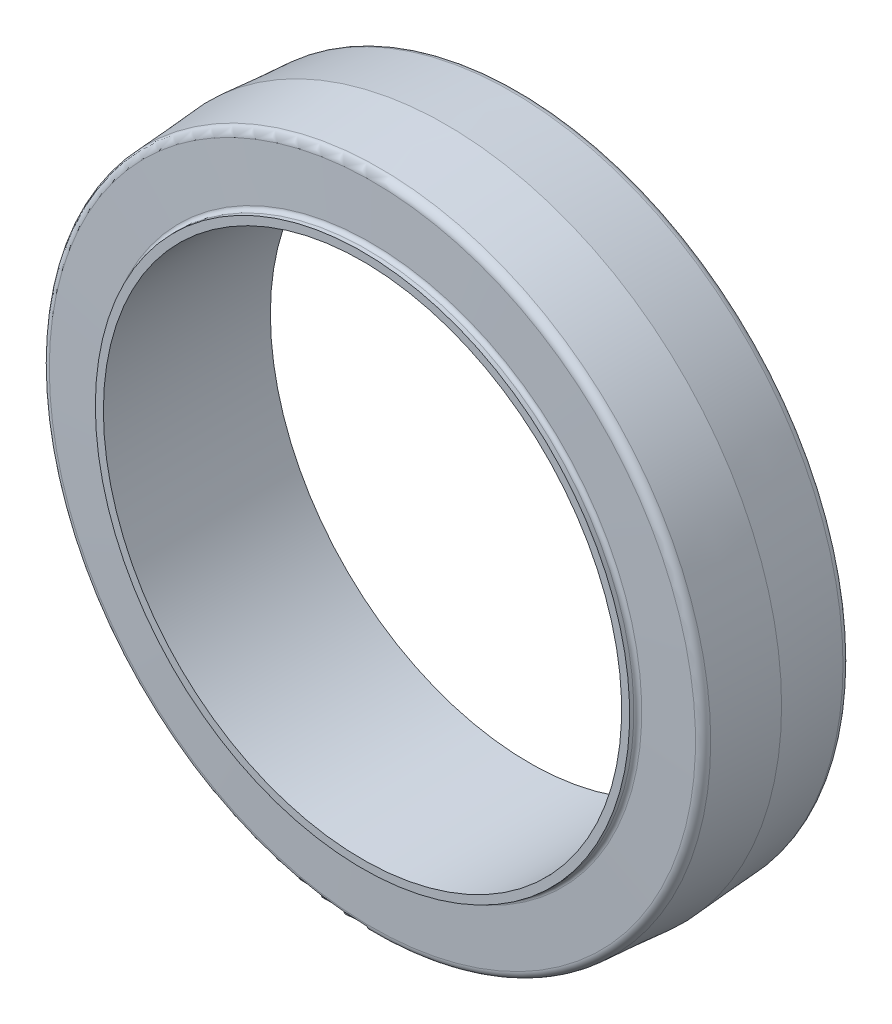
ISO-10303-21;
HEADER;
FILE_DESCRIPTION(('STEP AP214'),'2;1');
FILE_NAME('part.step','',(''),(''),'','','');
FILE_SCHEMA(('AUTOMOTIVE_DESIGN { 1 0 10303 214 1 1 1 1 }'));
ENDSEC;
DATA;
#1=APPLICATION_CONTEXT('core data for automotive mechanical design processes');
#2=APPLICATION_PROTOCOL_DEFINITION('international standard','automotive_design',2000,#1);
#3=PRODUCT_CONTEXT('',#1,'mechanical');
#4=PRODUCT('Part','Part','',(#3));
#5=PRODUCT_RELATED_PRODUCT_CATEGORY('part','',(#4));
#6=PRODUCT_DEFINITION_FORMATION('','',#4);
#7=PRODUCT_DEFINITION_CONTEXT('part definition',#1,'design');
#8=PRODUCT_DEFINITION('design','',#6,#7);
#9=PRODUCT_DEFINITION_SHAPE('','',#8);
#10=(LENGTH_UNIT() NAMED_UNIT(*) SI_UNIT(.MILLI.,.METRE.));
#11=(NAMED_UNIT(*) PLANE_ANGLE_UNIT() SI_UNIT($,.RADIAN.));
#12=(NAMED_UNIT(*) SI_UNIT($,.STERADIAN.) SOLID_ANGLE_UNIT());
#13=UNCERTAINTY_MEASURE_WITH_UNIT(LENGTH_MEASURE(1.E-05),#10,'distance_accuracy_value','');
#14=(GEOMETRIC_REPRESENTATION_CONTEXT(3) GLOBAL_UNCERTAINTY_ASSIGNED_CONTEXT((#13)) GLOBAL_UNIT_ASSIGNED_CONTEXT((#10,
#11,#12)) REPRESENTATION_CONTEXT('',''));
#15=CARTESIAN_POINT('',(0.,0.,0.));
#16=DIRECTION('',(0.,0.,1.));
#17=DIRECTION('',(1.,0.,0.));
#18=AXIS2_PLACEMENT_3D('',#15,#16,#17);
#19=CARTESIAN_POINT('',(0.,0.,0.));
#20=DIRECTION('',(0.,0.,-1.));
#21=DIRECTION('',(-1.,0.,0.));
#22=AXIS2_PLACEMENT_3D('',#19,#20,#21);
#23=CONICAL_SURFACE('',#22,63.5508,0.0712094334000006);
#24=CARTESIAN_POINT('',(0.,0.,7.27196081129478E-11));
#25=DIRECTION('',(0.,0.,1.));
#26=DIRECTION('',(1.,0.,0.));
#27=AXIS2_PLACEMENT_3D('',#24,#25,#26);
#28=CIRCLE('',#27,63.5507999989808);
#29=CARTESIAN_POINT('',(63.5507999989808,0.,7.27490984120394E-11));
#30=VERTEX_POINT('',#29);
#31=EDGE_CURVE('E124',#30,#30,#28,.F.);
#32=ORIENTED_EDGE('',*,*,#31,.F.);
#33=EDGE_LOOP('',(#32));
#34=FACE_BOUND('',#33,.T.);
#35=CARTESIAN_POINT('',(0.,0.,12.5251314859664));
#36=DIRECTION('',(0.,0.,-1.));
#37=DIRECTION('',(-1.,0.,0.));
#38=AXIS2_PLACEMENT_3D('',#35,#36,#37);
#39=CIRCLE('',#38,62.6573818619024);
#40=CARTESIAN_POINT('',(-62.6573818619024,0.,12.5251314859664));
#41=VERTEX_POINT('',#40);
#42=EDGE_CURVE('E121',#41,#41,#39,.F.);
#43=ORIENTED_EDGE('',*,*,#42,.F.);
#44=EDGE_LOOP('',(#43));
#45=FACE_BOUND('',#44,.T.);
#46=ADVANCED_FACE('F17',(#34,#45),#23,.T.);
#47=CARTESIAN_POINT('',(0.,0.,7.26727705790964E-11));
#48=DIRECTION('',(0.,0.,1.));
#49=DIRECTION('',(1.,0.,0.));
#50=AXIS2_PLACEMENT_3D('',#47,#48,#49);
#51=CONICAL_SURFACE('',#50,63.5507999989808,0.0712094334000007);
#52=ORIENTED_EDGE('',*,*,#31,.T.);
#53=EDGE_LOOP('',(#52));
#54=FACE_BOUND('',#53,.T.);
#55=CARTESIAN_POINT('',(0.,0.,-12.5251314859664));
#56=DIRECTION('',(0.,0.,-1.));
#57=DIRECTION('',(-1.,0.,0.));
#58=AXIS2_PLACEMENT_3D('',#55,#56,#57);
#59=CIRCLE('',#58,62.6573818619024);
#60=CARTESIAN_POINT('',(-62.6573818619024,0.,-12.5251314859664));
#61=VERTEX_POINT('',#60);
#62=EDGE_CURVE('E101',#61,#61,#59,.T.);
#63=ORIENTED_EDGE('',*,*,#62,.F.);
#64=EDGE_LOOP('',(#63));
#65=FACE_BOUND('',#64,.T.);
#66=ADVANCED_FACE('F116',(#54,#65),#51,.T.);
#67=CARTESIAN_POINT('',(0.,0.,12.416700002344));
#68=DIRECTION('',(0.,0.,-1.));
#69=DIRECTION('',(-1.,0.,0.));
#70=AXIS2_PLACEMENT_3D('',#67,#68,#69);
#71=TOROIDAL_SURFACE('',#70,61.1372441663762,1.524);
#72=ORIENTED_EDGE('',*,*,#42,.T.);
#73=EDGE_LOOP('',(#72));
#74=FACE_BOUND('',#73,.T.);
#75=CARTESIAN_POINT('',(0.,0.,13.9398796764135));
#76=DIRECTION('',(0.,0.,-1.));
#77=DIRECTION('',(-1.,0.,0.));
#78=AXIS2_PLACEMENT_3D('',#75,#76,#77);
#79=CIRCLE('',#78,61.1872409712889);
#80=CARTESIAN_POINT('',(-61.1872409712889,0.,13.9398796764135));
#81=VERTEX_POINT('',#80);
#82=EDGE_CURVE('E95',#81,#81,#79,.F.);
#83=ORIENTED_EDGE('',*,*,#82,.F.);
#84=EDGE_LOOP('',(#83));
#85=FACE_BOUND('',#84,.T.);
#86=ADVANCED_FACE('F112',(#74,#85),#71,.T.);
#87=CARTESIAN_POINT('',(0.,0.,-12.416700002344));
#88=DIRECTION('',(0.,0.,-1.));
#89=DIRECTION('',(-1.,0.,0.));
#90=AXIS2_PLACEMENT_3D('',#87,#88,#89);
#91=TOROIDAL_SURFACE('',#90,61.1372441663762,1.524);
#92=CARTESIAN_POINT('',(0.,0.,-13.939879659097));
#93=DIRECTION('',(0.,0.,1.));
#94=DIRECTION('',(1.,0.,0.));
#95=AXIS2_PLACEMENT_3D('',#92,#93,#94);
#96=CIRCLE('',#95,61.1872409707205);
#97=CARTESIAN_POINT('',(61.1872409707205,0.,-13.939879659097));
#98=VERTEX_POINT('',#97);
#99=EDGE_CURVE('E89',#98,#98,#96,.F.);
#100=ORIENTED_EDGE('',*,*,#99,.F.);
#101=EDGE_LOOP('',(#100));
#102=FACE_BOUND('',#101,.T.);
#103=ORIENTED_EDGE('',*,*,#62,.T.);
#104=EDGE_LOOP('',(#103));
#105=FACE_BOUND('',#104,.T.);
#106=ADVANCED_FACE('F108',(#102,#105),#91,.T.);
#107=CARTESIAN_POINT('',(0.,0.,13.9398796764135));
#108=DIRECTION('',(0.,0.,-1.));
#109=DIRECTION('',(-1.,0.,0.));
#110=AXIS2_PLACEMENT_3D('',#107,#108,#109);
#111=CONICAL_SURFACE('',#110,61.1872409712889,1.53798413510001);
#112=ORIENTED_EDGE('',*,*,#82,.T.);
#113=EDGE_LOOP('',(#112));
#114=FACE_BOUND('',#113,.T.);
#115=CARTESIAN_POINT('',(0.,0.,14.263308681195));
#116=DIRECTION('',(0.,0.,-1.));
#117=DIRECTION('',(-1.,0.,0.));
#118=AXIS2_PLACEMENT_3D('',#115,#116,#117);
#119=CIRCLE('',#118,51.3338015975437);
#120=CARTESIAN_POINT('',(-51.3338015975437,0.,14.263308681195));
#121=VERTEX_POINT('',#120);
#122=EDGE_CURVE('E86',#121,#121,#119,.T.);
#123=ORIENTED_EDGE('',*,*,#122,.T.);
#124=EDGE_LOOP('',(#123));
#125=FACE_BOUND('',#124,.T.);
#126=ADVANCED_FACE('F111',(#114,#125),#111,.T.);
#127=CARTESIAN_POINT('',(0.,0.,-13.939879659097));
#128=DIRECTION('',(0.,0.,1.));
#129=DIRECTION('',(0.,-1.,0.));
#130=AXIS2_PLACEMENT_3D('',#127,#128,#129);
#131=CONICAL_SURFACE('',#130,61.1872409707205,1.53798413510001);
#132=ORIENTED_EDGE('',*,*,#99,.T.);
#133=EDGE_LOOP('',(#132));
#134=FACE_BOUND('',#133,.T.);
#135=CARTESIAN_POINT('',(0.,0.,-14.263308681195));
#136=DIRECTION('',(0.,0.,-1.));
#137=DIRECTION('',(-1.,0.,0.));
#138=AXIS2_PLACEMENT_3D('',#135,#136,#137);
#139=CIRCLE('',#138,51.3338015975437);
#140=CARTESIAN_POINT('',(-51.3338015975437,0.,-14.263308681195));
#141=VERTEX_POINT('',#140);
#142=EDGE_CURVE('E58',#141,#141,#139,.F.);
#143=ORIENTED_EDGE('',*,*,#142,.T.);
#144=EDGE_LOOP('',(#143));
#145=FACE_BOUND('',#144,.T.);
#146=ADVANCED_FACE('F80',(#134,#145),#131,.T.);
#147=CARTESIAN_POINT('',(0.,0.,15.0248985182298));
#148=DIRECTION('',(0.,0.,-1.));
#149=DIRECTION('',(-1.,0.,0.));
#150=AXIS2_PLACEMENT_3D('',#147,#148,#149);
#151=TOROIDAL_SURFACE('',#150,51.3588,0.762);
#152=CARTESIAN_POINT('',(0.,0.,15.0248985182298));
#153=DIRECTION('',(0.,0.,-1.));
#154=DIRECTION('',(-1.,0.,0.));
#155=AXIS2_PLACEMENT_3D('',#152,#153,#154);
#156=CIRCLE('',#155,50.5968);
#157=CARTESIAN_POINT('',(-50.5968,0.,15.0248985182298));
#158=VERTEX_POINT('',#157);
#159=EDGE_CURVE('E52',#158,#158,#156,.F.);
#160=ORIENTED_EDGE('',*,*,#159,.F.);
#161=EDGE_LOOP('',(#160));
#162=FACE_BOUND('',#161,.T.);
#163=ORIENTED_EDGE('',*,*,#122,.F.);
#164=EDGE_LOOP('',(#163));
#165=FACE_BOUND('',#164,.T.);
#166=ADVANCED_FACE('F74',(#162,#165),#151,.F.);
#167=CARTESIAN_POINT('',(0.,0.,-15.0248985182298));
#168=DIRECTION('',(0.,0.,-1.));
#169=DIRECTION('',(-1.,0.,0.));
#170=AXIS2_PLACEMENT_3D('',#167,#168,#169);
#171=TOROIDAL_SURFACE('',#170,51.3588,0.762);
#172=ORIENTED_EDGE('',*,*,#142,.F.);
#173=EDGE_LOOP('',(#172));
#174=FACE_BOUND('',#173,.T.);
#175=CARTESIAN_POINT('',(0.,0.,-15.0248985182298));
#176=DIRECTION('',(0.,0.,-1.));
#177=DIRECTION('',(-1.,0.,0.));
#178=AXIS2_PLACEMENT_3D('',#175,#176,#177);
#179=CIRCLE('',#178,50.5968);
#180=CARTESIAN_POINT('',(-50.5968,0.,-15.0248985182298));
#181=VERTEX_POINT('',#180);
#182=EDGE_CURVE('E46',#181,#181,#179,.T.);
#183=ORIENTED_EDGE('',*,*,#182,.F.);
#184=EDGE_LOOP('',(#183));
#185=FACE_BOUND('',#184,.T.);
#186=ADVANCED_FACE('F69',(#174,#185),#171,.F.);
#187=CARTESIAN_POINT('',(0.,0.,0.));
#188=DIRECTION('',(0.,0.,-1.));
#189=DIRECTION('',(-1.,0.,0.));
#190=AXIS2_PLACEMENT_3D('',#187,#188,#189);
#191=CYLINDRICAL_SURFACE('',#190,50.5968);
#192=ORIENTED_EDGE('',*,*,#159,.T.);
#193=EDGE_LOOP('',(#192));
#194=FACE_BOUND('',#193,.T.);
#195=CARTESIAN_POINT('',(0.,0.,15.8115));
#196=DIRECTION('',(0.,0.,-1.));
#197=DIRECTION('',(-1.,0.,0.));
#198=AXIS2_PLACEMENT_3D('',#195,#196,#197);
#199=CIRCLE('',#198,50.5968);
#200=CARTESIAN_POINT('',(-50.5968,0.,15.8115));
#201=VERTEX_POINT('',#200);
#202=EDGE_CURVE('E20',#201,#201,#199,.F.);
#203=ORIENTED_EDGE('',*,*,#202,.F.);
#204=EDGE_LOOP('',(#203));
#205=FACE_BOUND('',#204,.T.);
#206=ADVANCED_FACE('F73',(#194,#205),#191,.T.);
#207=CARTESIAN_POINT('',(0.,0.,0.));
#208=DIRECTION('',(0.,0.,-1.));
#209=DIRECTION('',(-1.,0.,0.));
#210=AXIS2_PLACEMENT_3D('',#207,#208,#209);
#211=CYLINDRICAL_SURFACE('',#210,50.5968);
#212=CARTESIAN_POINT('',(0.,0.,-15.8115));
#213=DIRECTION('',(0.,0.,-1.));
#214=DIRECTION('',(-1.,0.,0.));
#215=AXIS2_PLACEMENT_3D('',#212,#213,#214);
#216=CIRCLE('',#215,50.5968);
#217=CARTESIAN_POINT('',(-50.5968,0.,-15.8115));
#218=VERTEX_POINT('',#217);
#219=EDGE_CURVE('E34',#218,#218,#216,.T.);
#220=ORIENTED_EDGE('',*,*,#219,.F.);
#221=EDGE_LOOP('',(#220));
#222=FACE_BOUND('',#221,.T.);
#223=ORIENTED_EDGE('',*,*,#182,.T.);
#224=EDGE_LOOP('',(#223));
#225=FACE_BOUND('',#224,.T.);
#226=ADVANCED_FACE('F158',(#222,#225),#211,.T.);
#227=CARTESIAN_POINT('',(0.,49.0728,15.8115));
#228=DIRECTION('',(0.,0.,1.));
#229=DIRECTION('',(1.,0.,0.));
#230=AXIS2_PLACEMENT_3D('',#227,#228,#229);
#231=PLANE('',#230);
#232=CARTESIAN_POINT('',(0.,0.,15.8115));
#233=DIRECTION('',(0.,0.,-1.));
#234=DIRECTION('',(-1.,0.,0.));
#235=AXIS2_PLACEMENT_3D('',#232,#233,#234);
#236=CIRCLE('',#235,49.0728);
#237=CARTESIAN_POINT('',(-49.0728,0.,15.8115));
#238=VERTEX_POINT('',#237);
#239=EDGE_CURVE('E25',#238,#238,#236,.T.);
#240=ORIENTED_EDGE('',*,*,#239,.T.);
#241=EDGE_LOOP('',(#240));
#242=FACE_BOUND('',#241,.T.);
#243=ORIENTED_EDGE('',*,*,#202,.T.);
#244=EDGE_LOOP('',(#243));
#245=FACE_BOUND('',#244,.T.);
#246=ADVANCED_FACE('F153',(#242,#245),#231,.T.);
#247=CARTESIAN_POINT('',(0.,49.0728,-15.8115));
#248=DIRECTION('',(0.,0.,-1.));
#249=DIRECTION('',(-1.,0.,0.));
#250=AXIS2_PLACEMENT_3D('',#247,#248,#249);
#251=PLANE('',#250);
#252=CARTESIAN_POINT('',(0.,0.,-15.8115));
#253=DIRECTION('',(0.,0.,-1.));
#254=DIRECTION('',(-1.,0.,0.));
#255=AXIS2_PLACEMENT_3D('',#252,#253,#254);
#256=CIRCLE('',#255,49.0728);
#257=CARTESIAN_POINT('',(-49.0728,0.,-15.8115));
#258=VERTEX_POINT('',#257);
#259=EDGE_CURVE('E10',#258,#258,#256,.F.);
#260=ORIENTED_EDGE('',*,*,#259,.T.);
#261=EDGE_LOOP('',(#260));
#262=FACE_BOUND('',#261,.T.);
#263=ORIENTED_EDGE('',*,*,#219,.T.);
#264=EDGE_LOOP('',(#263));
#265=FACE_BOUND('',#264,.T.);
#266=ADVANCED_FACE('F148',(#262,#265),#251,.T.);
#267=CARTESIAN_POINT('',(0.,0.,0.));
#268=DIRECTION('',(0.,0.,-1.));
#269=DIRECTION('',(-1.,0.,0.));
#270=AXIS2_PLACEMENT_3D('',#267,#268,#269);
#271=CYLINDRICAL_SURFACE('',#270,49.0728);
#272=ORIENTED_EDGE('',*,*,#259,.F.);
#273=EDGE_LOOP('',(#272));
#274=FACE_BOUND('',#273,.T.);
#275=ORIENTED_EDGE('',*,*,#239,.F.);
#276=EDGE_LOOP('',(#275));
#277=FACE_BOUND('',#276,.T.);
#278=ADVANCED_FACE('F146',(#274,#277),#271,.F.);
#279=CLOSED_SHELL('',(#46,#66,#86,#106,#126,#146,#166,#186,#206,#226,#246,#266,#278));
#280=MANIFOLD_SOLID_BREP('B1',#279);
#281=ADVANCED_BREP_SHAPE_REPRESENTATION('',(#18,#280),#14);
#282=SHAPE_DEFINITION_REPRESENTATION(#9,#281);
ENDSEC;
END-ISO-10303-21;
